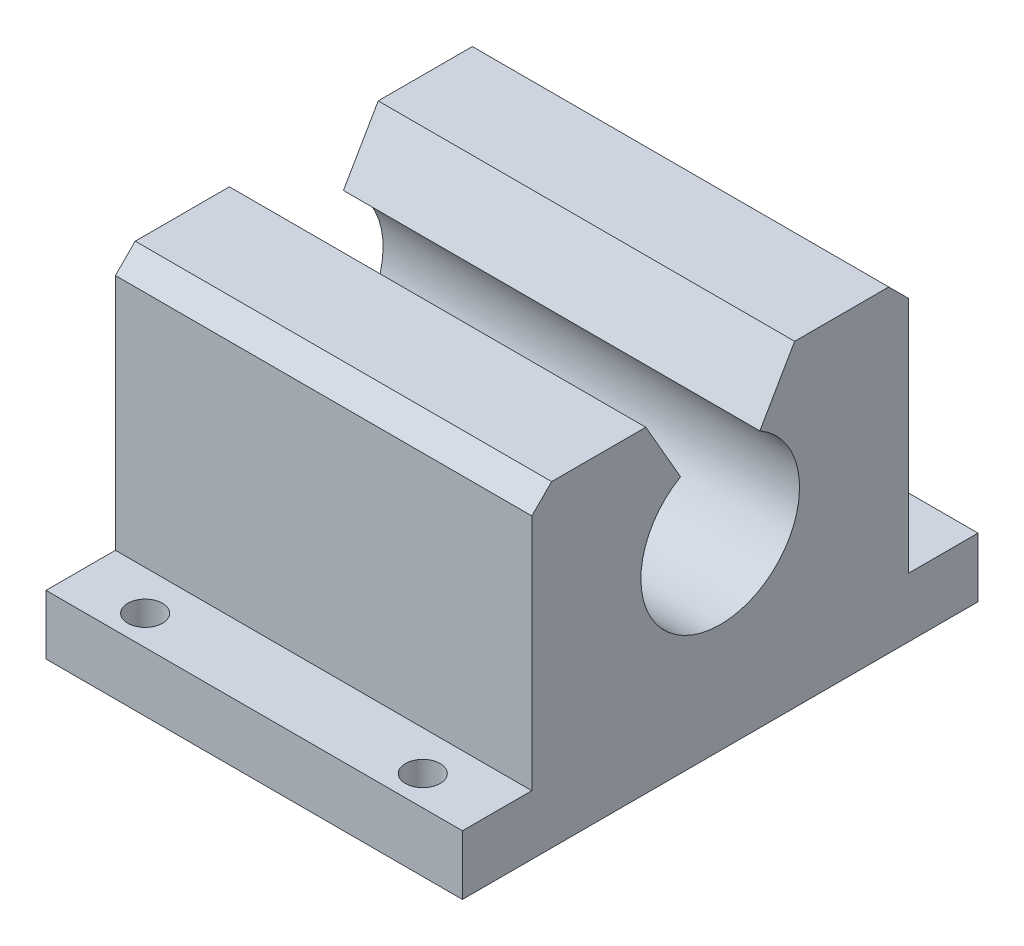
from build123d import *

# Parameters (mm, degrees)
SKETCH1_R            = 12.7
BASE_EXTRUDE_DEPTH   = 66.675
SKETCH2_R            = 2.778125
CUT_EXTRUDE1_DEPTH   = 89.61606443
LPATTERN1_COUNT      = 2
LPATTERN1_PITCH      = 44.45
LPATTERN1_COUNT_DIR2 = 2
LPATTERN1_PITCH_DIR2 = 73.025
CUT_EXTRUDE2_DEPTH   = 94.433512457
CHAMFER1_SIZE        = 3.175


with BuildPart() as part:
    # Sketch1 → Base-Extrude (new body)
    with BuildSketch(Plane(origin=(0, 0, 0), x_dir=(0, 0, -1), z_dir=(1, 0, 0))):
        Polygon((-41.275, 0), (41.275, 0), (41.275, 9.525), (30.1625, 9.525), (30.1625, 50.8), (-30.1625, 50.8), (-30.1625, 9.525), (-41.275, 9.525), align=None)
        with Locations((0, 30.1625)):
            Circle(SKETCH1_R, mode=Mode.SUBTRACT)
    extrude(amount=BASE_EXTRUDE_DEPTH)

    # Sketch2 → Cut-Extrude1 (cut, through all)
    with BuildSketch(Plane(origin=(0, 9.525, 0), x_dir=(-1, 0, 0), z_dir=(0, 1, 0))):
        with Locations(Location((-55.5625, 36.5125, 0), (0, 0, 90))):
            Circle(SKETCH2_R)
    cut_extrude1 = extrude(amount=-CUT_EXTRUDE1_DEPTH, mode=Mode.SUBTRACT)

    # LPattern1: Cut-Extrude1 2 × 2
    with Locations(*[(-i * LPATTERN1_PITCH, 0, -j * LPATTERN1_PITCH_DIR2) for i in range(LPATTERN1_COUNT) for j in range(LPATTERN1_COUNT_DIR2) if (i, j) != (0, 0)]):
        add(cut_extrude1, mode=Mode.SUBTRACT)

    # Sketch3 → Cut-Extrude2 (cut, through all)
    with BuildSketch(Plane(origin=(66.675, 0, 0), x_dir=(0, 0, -1), z_dir=(1, 0, 0))):
        Polygon((11.91506618, 50.8), (-11.91506618, 50.8), (0, 30.1625), align=None)
    extrude(amount=-CUT_EXTRUDE2_DEPTH, mode=Mode.SUBTRACT)

    # Chamfer1
    chamfer1_edges = [part.edges().sort_by_distance(p)[0] for p in [
        (33.3375, 50.8, 30.1625),
        (33.3375, 50.8, -30.1625),
    ]]
    chamfer(chamfer1_edges, length=CHAMFER1_SIZE)


solid = part.part
